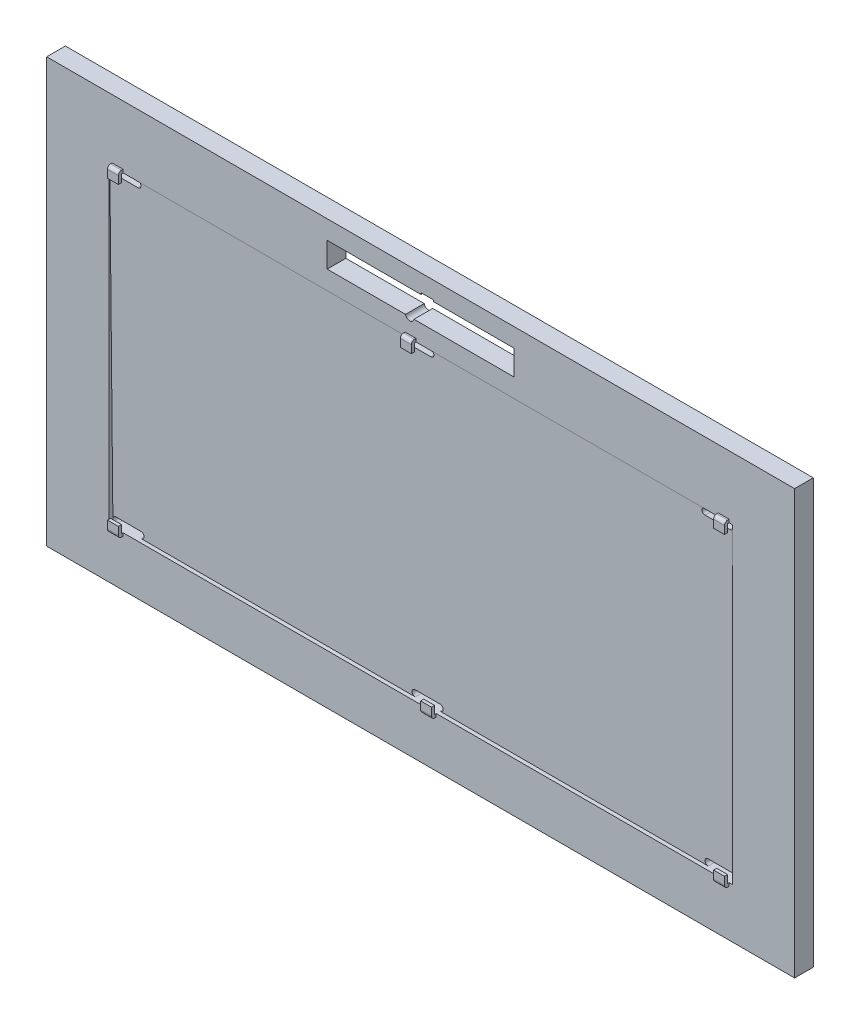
from build123d import *

# Parameters (mm, degrees)
ESQUISSE1_W              = 240
ESQUISSE1_H              = 136
EXTRUSION1_DEPTH         = 3
ESQUISSE2_W              = 60
ESQUISSE2_H              = 8
ENL_V_MAT_EXTRU_1_DEPTH  = 139.057958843
ESQUISSE3_W              = 4.1
ESQUISSE3_H              = 2.712560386
ENL_V_MAT_EXTRU_2_DEPTH  = 4
ESQUISSE4_R              = 1.375
ENL_V_MAT_EXTRU_3_DEPTH  = 139.057958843
ENL_V_MAT_EXTRU_5_DEPTH  = 100
ENL_V_MAT_EXTRU_7_DEPTH  = 5.5
ESQUISSE8_W              = 3.5
ESQUISSE8_H              = 3.5
EXTRUSION2_DEPTH         = 1.5
CONG_1_R                 = 1
ESQUISSE9_W              = 0.5
ESQUISSE9_H              = 2.5
ENL_V_MAT_EXTRU_8_DEPTH  = 226.065546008
ESQUISSE10_W             = 0.5
ESQUISSE10_H             = 2.5
ENL_V_MAT_EXTRU_9_DEPTH  = 226.065546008
ESQUISSE11_W             = 3.5
ESQUISSE11_H             = 3.5
EXTRUSION3_DEPTH         = 1.5
ESQUISSE12_W             = 3.5
ESQUISSE12_H             = 3.5
EXTRUSION4_DEPTH         = 1.5
ESQUISSE13_W             = 3.5
ESQUISSE13_H             = 3.5
EXTRUSION5_DEPTH         = 1.5
CONG_2_R                 = 1
ESQUISSE14_W             = 0.5
ESQUISSE14_H             = 2.5
ENL_V_MAT_EXTRU_10_DEPTH = 230.358344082
ESQUISSE15_W             = 0.5
ESQUISSE15_H             = 2.5
ENL_V_MAT_EXTRU_11_DEPTH = 230.358344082


with BuildPart() as part:
    # Esquisse1 → Extrusion1 (new, symmetric)
    with BuildSketch(Plane.XY):
        Rectangle(ESQUISSE1_W, ESQUISSE1_H)
    extrude(amount=EXTRUSION1_DEPTH, both=True)

    # Esquisse2 → Enl_v. mat.-Extru.1 (cut, through all)
    with BuildSketch(Plane.XY.offset(3)):
        with Locations((0, 58)):
            Rectangle(ESQUISSE2_W, ESQUISSE2_H)
    extrude(amount=-ENL_V_MAT_EXTRU_1_DEPTH, mode=Mode.SUBTRACT)

    # Esquisse3 → Enl_v. mat.-Extru.2 (cut)
    with BuildSketch(Plane.XY.offset(3)):
        with Locations((2.15, 61.143719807)):
            Rectangle(ESQUISSE3_W, ESQUISSE3_H)
    extrude(amount=-ENL_V_MAT_EXTRU_2_DEPTH, mode=Mode.SUBTRACT)

    # Esquisse4 → Enl_v. mat.-Extru.3 (cut, through all)
    with BuildSketch(Plane.XY.offset(3)):
        with Locations((-3.5, 54.25)):
            Circle(ESQUISSE4_R)
    extrude(amount=-ENL_V_MAT_EXTRU_3_DEPTH, mode=Mode.SUBTRACT)

    # Esquisse6 → Enl_v. mat.-Extru.5 (cut, symmetric)
    with BuildSketch(Plane(origin=(0, 0, 0), x_dir=(0, 0, -1), z_dir=(1, 0, 0))):
        Polygon((3, 48), (2.75, 48), (1.75, -52), (3, -52), align=None)
        Polygon((-2.75, 48), (-3, 48), (-3, -52), (-1.75, -52), align=None)
    extrude(amount=ENL_V_MAT_EXTRU_5_DEPTH, both=True, mode=Mode.SUBTRACT)

    # Esquisse7 → Enl_v. mat.-Extru.7 (cut, symmetric)
    with BuildSketch(Plane.XY):
        with BuildLine():
            Line((99, 48), (91, 48))
            ThreePointArc((91, 48), (90, 47), (91, 46))
            Line((91, 46), (99, 46))
            ThreePointArc((99, 46), (100, 47), (99, 48))
        make_face()
        with BuildLine():
            Line((-99, 46), (-91, 46))
            ThreePointArc((-91, 46), (-90, 47), (-91, 48))
            Line((-91, 48), (-99, 48))
            ThreePointArc((-99, 48), (-100, 47), (-99, 46))
        make_face()
        with BuildLine():
            Line((99, -50), (91, -50))
            ThreePointArc((91, -50), (90, -51), (91, -52))
            Line((91, -52), (99, -52))
            ThreePointArc((99, -52), (100, -51), (99, -50))
        make_face()
        with BuildLine():
            Line((-99, -50), (-91, -50))
            ThreePointArc((-91, -50), (-90, -51), (-91, -52))
            Line((-91, -52), (-99, -52))
            ThreePointArc((-99, -52), (-100, -51), (-99, -50))
        make_face()
        with BuildLine():
            Line((3, 48), (-5, 48))
            ThreePointArc((-5, 48), (-6, 47), (-5, 46))
            Line((-5, 46), (3, 46))
            ThreePointArc((3, 46), (4, 47), (3, 48))
        make_face()
        with BuildLine():
            Line((5, -50), (-3, -50))
            ThreePointArc((-3, -50), (-4, -51), (-3, -52))
            Line((-3, -52), (5, -52))
            ThreePointArc((5, -52), (6, -51), (5, -50))
        make_face()
    extrude(amount=ENL_V_MAT_EXTRU_7_DEPTH, both=True, mode=Mode.SUBTRACT)

    # Esquisse8 → Extrusion2 (add)
    with BuildSketch(Plane(origin=(0, 0, -3), x_dir=(-1, 0, 0), z_dir=(0, 0, -1))):
        with Locations((-92.75, 47.25)):
            Rectangle(ESQUISSE8_W, ESQUISSE8_H)
        with Locations((92.75, 47.25)):
            Rectangle(ESQUISSE8_W, ESQUISSE8_H)
        with Locations((92.75, -51.25)):
            Rectangle(ESQUISSE8_W, ESQUISSE8_H)
        with Locations((-92.75, -51.25)):
            Rectangle(ESQUISSE8_W, ESQUISSE8_H)
        with Locations((-1.25, 47.25)):
            Rectangle(ESQUISSE8_W, ESQUISSE8_H)
        with Locations((1.25, -51.25)):
            Rectangle(ESQUISSE8_W, ESQUISSE8_H)
    extrude(amount=EXTRUSION2_DEPTH)

    # Cong_1
    cong_1_edges = [part.edges().sort_by_distance(p)[0] for p in [
        (92.75, 49, -4.5),
        (-92.75, 49, -4.5),
        (-92.75, -53, -4.5),
        (92.75, -53, -4.5),
        (1.25, 49, -4.5),
        (-1.25, -53, -4.5),
    ]]
    fillet(cong_1_edges, radius=CONG_1_R)

    # Esquisse9 → Enl_v. mat.-Extru.8 (cut, through all)
    with BuildSketch(Plane.ZY.offset(94.5)):
        with Locations((-3.25, 46.75)):
            Rectangle(ESQUISSE9_W, ESQUISSE9_H)
    extrude(amount=-ENL_V_MAT_EXTRU_8_DEPTH, mode=Mode.SUBTRACT)

    # Esquisse10 → Enl_v. mat.-Extru.9 (cut, through all)
    with BuildSketch(Plane.ZY.offset(94.5)):
        with Locations((-3.25, -50.75)):
            Rectangle(ESQUISSE10_W, ESQUISSE10_H)
    extrude(amount=-ENL_V_MAT_EXTRU_9_DEPTH, mode=Mode.SUBTRACT)

    # Esquisse11 → Extrusion3 (add)
    with BuildSketch(Plane.XY.offset(3)):
        with Locations((-97.25, 47.25)):
            Rectangle(ESQUISSE11_W, ESQUISSE11_H)
        with Locations((97.25, 47.25)):
            Rectangle(ESQUISSE11_W, ESQUISSE11_H)
        with Locations((-97.25, -51.25)):
            Rectangle(ESQUISSE11_W, ESQUISSE11_H)
        with Locations((97.25, -51.25)):
            Rectangle(ESQUISSE11_W, ESQUISSE11_H)
    extrude(amount=EXTRUSION3_DEPTH)

    # Esquisse12 → Extrusion4 (add)
    with BuildSketch(Plane.XY.offset(3)):
        with Locations((-3.25, 47.25)):
            Rectangle(ESQUISSE12_W, ESQUISSE12_H)
    extrude(amount=EXTRUSION4_DEPTH)

    # Esquisse13 → Extrusion5 (add)
    with BuildSketch(Plane.XY.offset(3)):
        with Locations((3.25, -51.25)):
            Rectangle(ESQUISSE13_W, ESQUISSE13_H)
    extrude(amount=EXTRUSION5_DEPTH)

    # Cong_2
    cong_2_edges = [part.edges().sort_by_distance(p)[0] for p in [
        (-97.25, 49, 4.5),
        (97.25, 49, 4.5),
        (-97.25, -53, 4.5),
        (97.25, -53, 4.5),
        (-3.25, 49, 4.5),
        (3.25, -53, 4.5),
    ]]
    fillet(cong_2_edges, radius=CONG_2_R)

    # Esquisse14 → Enl_v. mat.-Extru.10 (cut, through all)
    with BuildSketch(Plane(origin=(99, 0, 0), x_dir=(0, 0, -1), z_dir=(1, 0, 0))):
        with Locations((-3.25, 46.75)):
            Rectangle(ESQUISSE14_W, ESQUISSE14_H)
    extrude(amount=-ENL_V_MAT_EXTRU_10_DEPTH, mode=Mode.SUBTRACT)

    # Esquisse15 → Enl_v. mat.-Extru.11 (cut, through all)
    with BuildSketch(Plane(origin=(99, 0, 0), x_dir=(0, 0, -1), z_dir=(1, 0, 0))):
        with Locations((-3.25, -50.75)):
            Rectangle(ESQUISSE15_W, ESQUISSE15_H)
    extrude(amount=-ENL_V_MAT_EXTRU_11_DEPTH, mode=Mode.SUBTRACT)


solid = part.part
